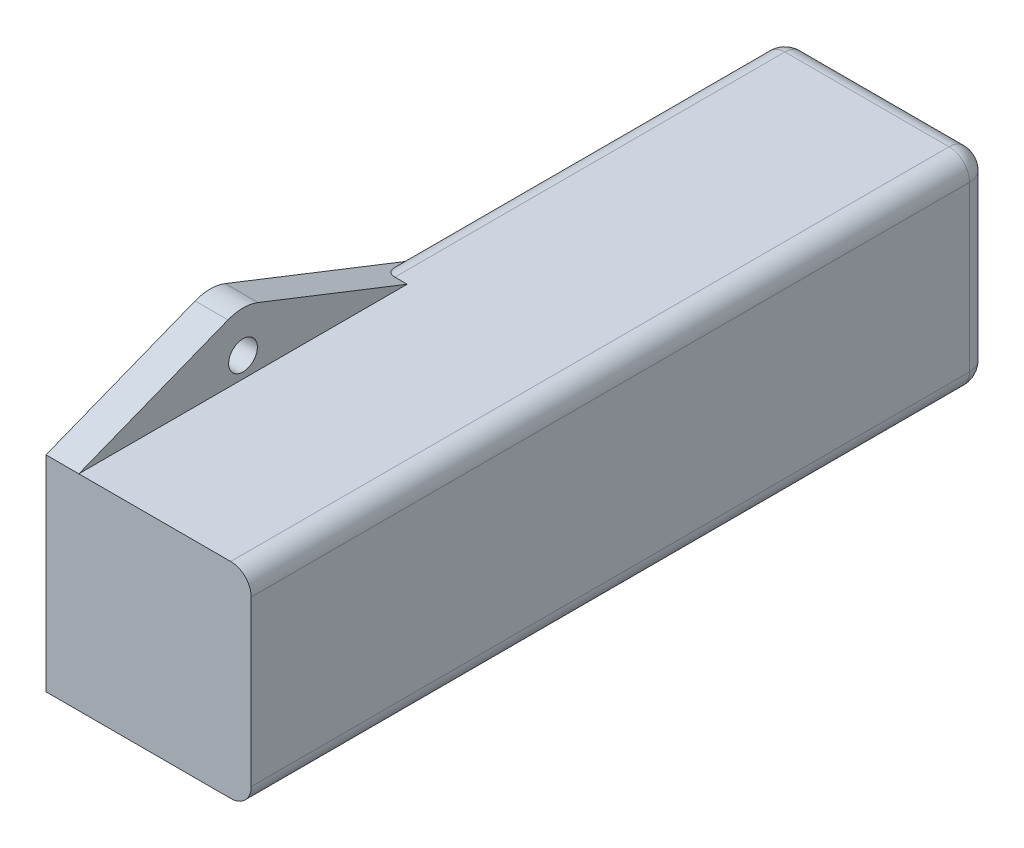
from build123d import *

# Parameters (mm, degrees)
ESQUISSE1_W      = 90
ESQUISSE1_H      = 25
EXTRUSION1_DEPTH = 25
ESQUISSE2_R      = 1.75
EXTRUSION2_DEPTH = 4
CONG_1_R         = 2.5


with BuildPart() as part:
    # Esquisse1 → Extrusion1 (new body)
    with BuildSketch(Plane(origin=(0, 0, 0), x_dir=(0, 0, -1), z_dir=(1, 0, 0))):
        Rectangle(ESQUISSE1_W, ESQUISSE1_H)
    extrude(amount=EXTRUSION1_DEPTH)

    # Esquisse2 → Extrusion2 (add)
    with BuildSketch(Plane.ZY):
        with BuildLine():
            Line((5, 12.5), (23.168442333, 19.652461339))
            ThreePointArc((23.168442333, 19.652461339), (25, 20), (26.831557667, 19.652461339))
            Line((26.831557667, 19.652461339), (45, 12.5))
            Line((45, 12.5), (45, -12.5))
            Line((45, -12.5), (26.831557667, -19.652461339))
            ThreePointArc((26.831557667, -19.652461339), (25, -20), (23.168442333, -19.652461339))
            Line((23.168442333, -19.652461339), (5, -12.5))
            Line((5, -12.5), (5, 12.5))
        make_face()
        with Locations((25, 15)):
            Circle(ESQUISSE2_R, mode=Mode.SUBTRACT)
        with Locations((25, -15)):
            Circle(ESQUISSE2_R, mode=Mode.SUBTRACT)
    extrude(amount=-EXTRUSION2_DEPTH)

    # Cong_1
    cong_1_edges = [part.edges().sort_by_distance(p)[0] for p in [
        (25, 0, -45),
        (25, 12.5, 0),
        (0, -12.5, -20),
        (0, 12.5, -20),
        (0, 0, -45),
        (25, -12.5, 0),
        (12.5, 12.5, -45),
        (12.5, -12.5, -45),
    ]]
    fillet(cong_1_edges, radius=CONG_1_R)


solid = part.part
